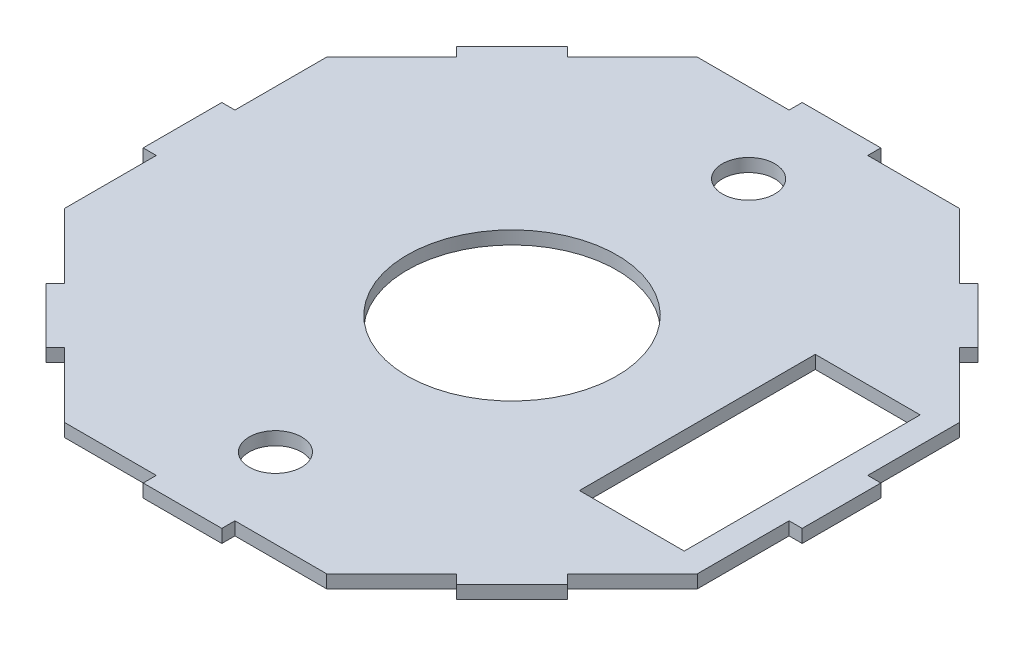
from build123d import *

# Parameters (mm, degrees)
CROQUIS1_R              = 10
CROQUIS1_R_2            = 40
SALIENTE_EXTRUIR1_DEPTH = 5
CROQUIS3_W              = 40
CROQUIS3_H              = 90
CORTAR_EXTRUIR2_DEPTH   = 5


with BuildPart() as part:
    # Croquis1 → Saliente-Extruir1 (new body)
    with BuildSketch(Plane(origin=(0, 0, 0), x_dir=(1, 0, 0), z_dir=(0, 1, 0))):
        Polygon((-30.908981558, -85.661724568), (-30.908981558, -50.661724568), (-35.908981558, -50.661724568), (-35.908981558, -20.661724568), (-30.908981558, -20.661724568), (-30.908981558, 14.338275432), (-6.160244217, 39.087012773), (-9.695778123, 42.622546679), (11.517425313, 63.835750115), (15.052959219, 60.300216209), (39.80169656, 85.04895355), (74.80169656, 85.04895355), (74.80169656, 90.04895355), (104.80169656, 90.04895355), (104.80169656, 85.04895355), (139.80169656, 85.04895355), (164.550433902, 60.300216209), (168.085967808, 63.835750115), (189.299171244, 42.622546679), (185.763637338, 39.087012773), (210.512374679, 14.338275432), (210.512374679, -20.661724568), (215.512374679, -20.661724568), (215.512374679, -50.661724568), (210.512374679, -50.661724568), (210.512374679, -85.661724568), (185.763637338, -110.41046191), (189.299171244, -113.945995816), (168.085967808, -135.159199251), (164.550433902, -131.623665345), (139.80169656, -156.372402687), (104.80169656, -156.372402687), (104.80169656, -161.372402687), (74.80169656, -161.372402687), (74.80169656, -156.372402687), (39.80169656, -156.372402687), (15.052959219, -131.623665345), (11.517425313, -135.159199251), (-9.695778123, -113.945995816), (-6.160244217, -110.41046191), align=None)
        with Locations(Location((89.80169656, 54.599222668, 0), (0, 0, 270))):
            Circle(CROQUIS1_R, mode=Mode.SUBTRACT)
        with Locations(Location((89.80169656, -35.661724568, 0), (0, 0, 270))):
            Circle(CROQUIS1_R_2, mode=Mode.SUBTRACT)
        with Locations(Location((89.80169656, -125.922671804, 0), (0, 0, 270))):
            Circle(CROQUIS1_R, mode=Mode.SUBTRACT)
    extrude(amount=SALIENTE_EXTRUIR1_DEPTH)

    # Croquis3 → Cortar-Extruir2 (cut)
    with BuildSketch(Plane.XZ):
        with Locations((180.512374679, 35.661724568)):
            Rectangle(CROQUIS3_W, CROQUIS3_H)
    extrude(amount=-CORTAR_EXTRUIR2_DEPTH, mode=Mode.SUBTRACT)


solid = part.part
